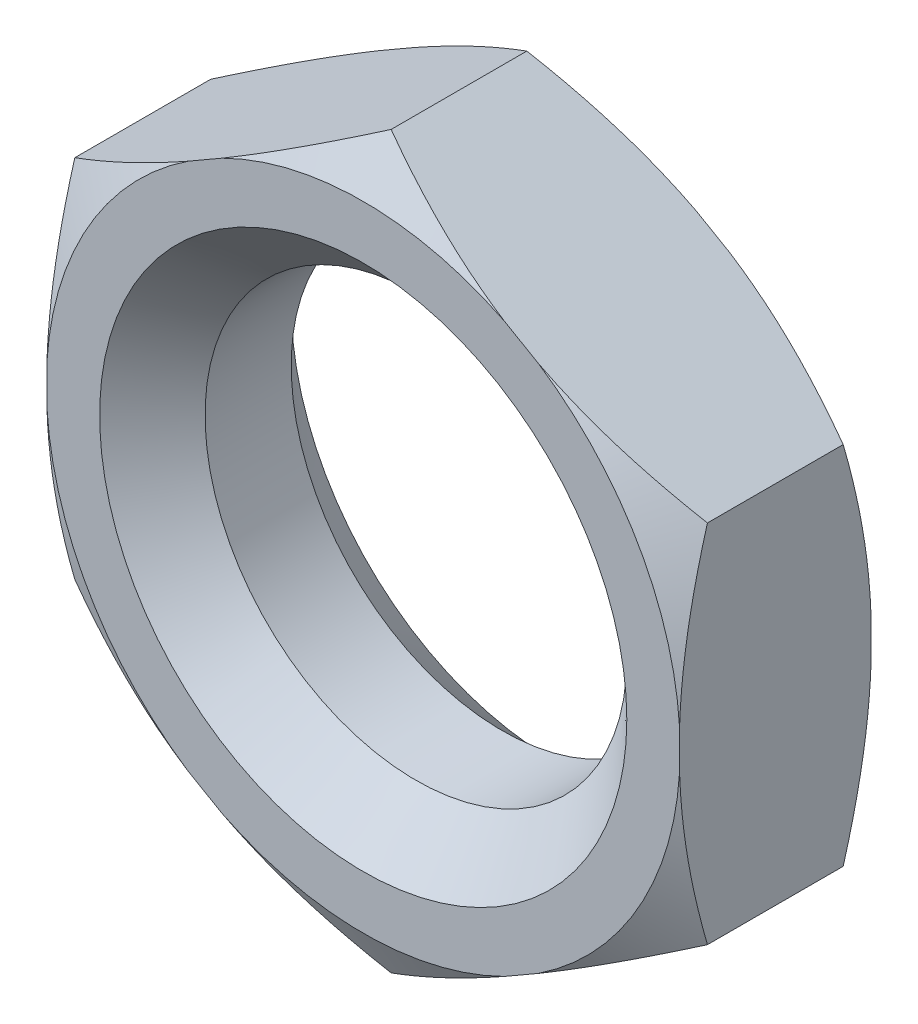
from build123d import *

# Parameters (mm, degrees)
BOSS_EXTRUDE1_DEPTH = 5.45
SKETCH6_R           = 12
CUT_EXTRUDE1_DEPTH  = 10.9
CHAMFER1_SIZE       = 3


with BuildPart() as part:
    # Sketch3 → Boss-Extrude1 (new, symmetric)
    with BuildSketch(Plane.XY):
        Polygon((0, 20.784609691), (-18, 10.392304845), (-18, -10.392304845), (0, -20.784609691), (18, -10.392304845), (18, 10.392304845), align=None)
    extrude(amount=BOSS_EXTRUDE1_DEPTH, both=True)

    # Sketch5 → Cut-Revolve1 (revolve, cut)
    with BuildSketch(Plane(origin=(0, 0, 0), x_dir=(0, 0, -1), z_dir=(1, 0, 0))):
        Polygon((-5.45, 20.784609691), (-5.45, 18.034609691), (-3.86228676, 20.784609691), align=None)
    cut_revolve1 = revolve(axis=Axis((0, 0, 5.457798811), (0, 0, -1)), mode=Mode.SUBTRACT)

    # Mirror1: Cut-Revolve1 across plane
    add(cut_revolve1.mirror(Plane.XY), mode=Mode.SUBTRACT)

    # Sketch6 → Cut-Extrude1 (cut)
    with BuildSketch(Plane.XY.offset(5.45)):
        Circle(SKETCH6_R)
    extrude(amount=-CUT_EXTRUDE1_DEPTH, mode=Mode.SUBTRACT)

    # Chamfer1
    chamfer1_edges = [part.edges().sort_by_distance(p)[0] for p in [
        (-12, 0, -5.45),
        (-12, 0, 5.45),
    ]]
    chamfer(chamfer1_edges, length=CHAMFER1_SIZE)


solid = part.part
